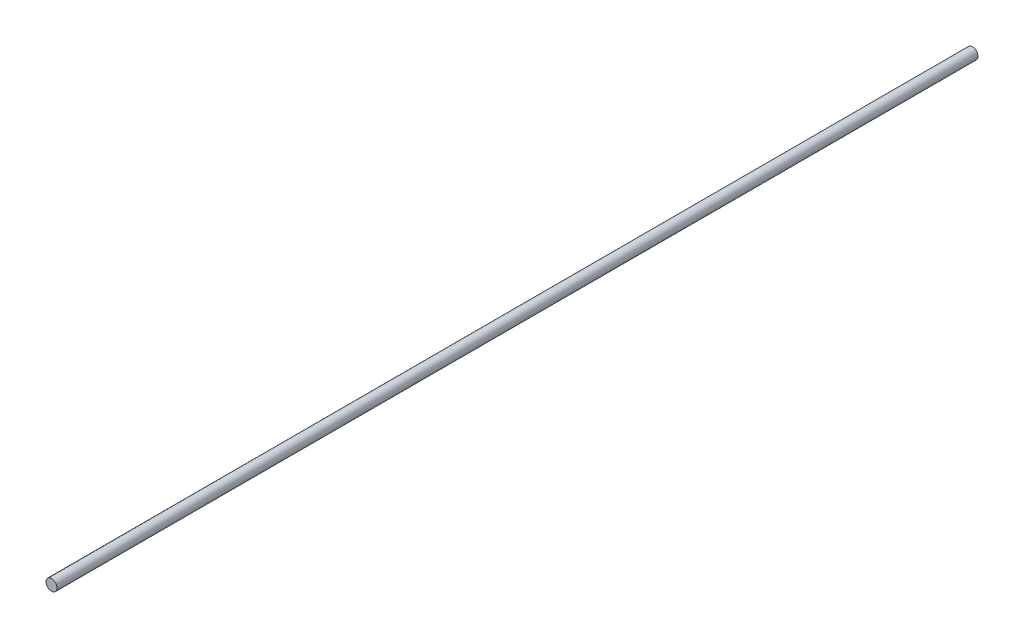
ISO-10303-21;
HEADER;
FILE_DESCRIPTION(('STEP AP214'),'2;1');
FILE_NAME('part.step','',(''),(''),'','','');
FILE_SCHEMA(('AUTOMOTIVE_DESIGN { 1 0 10303 214 1 1 1 1 }'));
ENDSEC;
DATA;
#1=APPLICATION_CONTEXT('core data for automotive mechanical design processes');
#2=APPLICATION_PROTOCOL_DEFINITION('international standard','automotive_design',2000,#1);
#3=PRODUCT_CONTEXT('',#1,'mechanical');
#4=PRODUCT('Part','Part','',(#3));
#5=PRODUCT_RELATED_PRODUCT_CATEGORY('part','',(#4));
#6=PRODUCT_DEFINITION_FORMATION('','',#4);
#7=PRODUCT_DEFINITION_CONTEXT('part definition',#1,'design');
#8=PRODUCT_DEFINITION('design','',#6,#7);
#9=PRODUCT_DEFINITION_SHAPE('','',#8);
#10=(LENGTH_UNIT() NAMED_UNIT(*) SI_UNIT(.MILLI.,.METRE.));
#11=(NAMED_UNIT(*) PLANE_ANGLE_UNIT() SI_UNIT($,.RADIAN.));
#12=(NAMED_UNIT(*) SI_UNIT($,.STERADIAN.) SOLID_ANGLE_UNIT());
#13=UNCERTAINTY_MEASURE_WITH_UNIT(LENGTH_MEASURE(1.E-05),#10,'distance_accuracy_value','');
#14=(GEOMETRIC_REPRESENTATION_CONTEXT(3) GLOBAL_UNCERTAINTY_ASSIGNED_CONTEXT((#13)) GLOBAL_UNIT_ASSIGNED_CONTEXT((#10,
#11,#12)) REPRESENTATION_CONTEXT('',''));
#15=CARTESIAN_POINT('',(0.,0.,0.));
#16=DIRECTION('',(0.,0.,1.));
#17=DIRECTION('',(1.,0.,0.));
#18=AXIS2_PLACEMENT_3D('',#15,#16,#17);
#19=CARTESIAN_POINT('',(0.,0.,-5000.));
#20=DIRECTION('',(0.,0.,1.));
#21=DIRECTION('',(1.,0.,0.));
#22=AXIS2_PLACEMENT_3D('',#19,#20,#21);
#23=CYLINDRICAL_SURFACE('',#22,30.);
#24=CARTESIAN_POINT('',(0.,0.,-5000.));
#25=DIRECTION('',(0.,0.,1.));
#26=DIRECTION('',(1.,0.,0.));
#27=AXIS2_PLACEMENT_3D('',#24,#25,#26);
#28=CIRCLE('',#27,30.);
#29=CARTESIAN_POINT('',(30.,0.,-5000.));
#30=VERTEX_POINT('',#29);
#31=EDGE_CURVE('E10',#30,#30,#28,.T.);
#32=ORIENTED_EDGE('',*,*,#31,.T.);
#33=EDGE_LOOP('',(#32));
#34=FACE_BOUND('',#33,.T.);
#35=CARTESIAN_POINT('',(0.,0.,0.));
#36=DIRECTION('',(0.,0.,1.));
#37=DIRECTION('',(1.,0.,0.));
#38=AXIS2_PLACEMENT_3D('',#35,#36,#37);
#39=CIRCLE('',#38,30.);
#40=CARTESIAN_POINT('',(30.,0.,0.));
#41=VERTEX_POINT('',#40);
#42=EDGE_CURVE('E40',#41,#41,#39,.T.);
#43=ORIENTED_EDGE('',*,*,#42,.F.);
#44=EDGE_LOOP('',(#43));
#45=FACE_BOUND('',#44,.T.);
#46=ADVANCED_FACE('F37',(#34,#45),#23,.T.);
#47=CARTESIAN_POINT('',(0.,0.,-5000.));
#48=DIRECTION('',(0.,0.,1.));
#49=DIRECTION('',(1.,0.,0.));
#50=AXIS2_PLACEMENT_3D('',#47,#48,#49);
#51=PLANE('',#50);
#52=ORIENTED_EDGE('',*,*,#31,.F.);
#53=EDGE_LOOP('',(#52));
#54=FACE_BOUND('',#53,.T.);
#55=ADVANCED_FACE('F54',(#54),#51,.F.);
#56=CARTESIAN_POINT('',(0.,0.,0.));
#57=DIRECTION('',(0.,0.,1.));
#58=DIRECTION('',(1.,0.,0.));
#59=AXIS2_PLACEMENT_3D('',#56,#57,#58);
#60=PLANE('',#59);
#61=ORIENTED_EDGE('',*,*,#42,.T.);
#62=EDGE_LOOP('',(#61));
#63=FACE_BOUND('',#62,.T.);
#64=ADVANCED_FACE('F51',(#63),#60,.T.);
#65=CLOSED_SHELL('',(#46,#55,#64));
#66=MANIFOLD_SOLID_BREP('B2',#65);
#67=ADVANCED_BREP_SHAPE_REPRESENTATION('',(#18,#66),#14);
#68=SHAPE_DEFINITION_REPRESENTATION(#9,#67);
ENDSEC;
END-ISO-10303-21;
